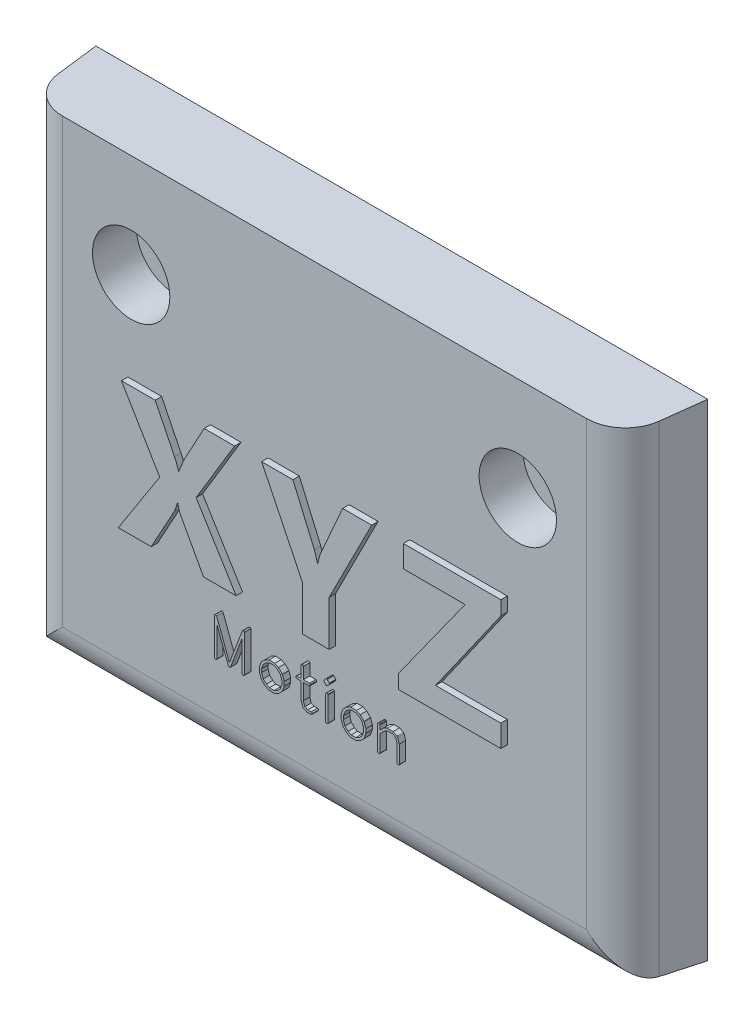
from build123d import *

# Parameters (mm, degrees)
SKETCH_1_W          = 46
SKETCH_1_H          = 37
EXTRUDE_1_DEPTH     = 6
SKETCH_2_R          = 3
CUT_EXTRUDE_1_DEPTH = 3.4
SKETCH_3_R          = 1.7
CUT_EXTRUDE_2_DEPTH = 6
DRAFT_1_ANGLE       = 7
DRAFT_2_ANGLE       = 7
DRAFT_4_ANGLE       = 7
SHELL_1_T           = -1.5
FILLET_1_R          = 1.5
FILLET_2_R          = 3
CUT_EXTRUDE_3_DEPTH = 0.2
EXTRUDE_2_DEPTH     = 0.5


with BuildPart() as part:
    # Sketch 1 → Extrude 1 (new body)
    with BuildSketch(Plane.XY):
        Rectangle(SKETCH_1_W, SKETCH_1_H)
    extrude(amount=EXTRUDE_1_DEPTH)

    # Sketch 2 → Cut-Extrude 1 (cut)
    with BuildSketch(Plane.XY.offset(6)):
        with Locations((-15, 10.5)):
            Circle(SKETCH_2_R)
        with Locations((15, 10.5)):
            Circle(SKETCH_2_R)
    extrude(amount=-CUT_EXTRUDE_1_DEPTH, mode=Mode.SUBTRACT)

    # Sketch 3 → Cut-Extrude 2 (cut)
    with BuildSketch(Plane.XY.offset(6)):
        with Locations((-15, 10.5)):
            Circle(SKETCH_3_R)
        with Locations((15, 10.5)):
            Circle(SKETCH_3_R)
    extrude(amount=-CUT_EXTRUDE_2_DEPTH, mode=Mode.SUBTRACT)

    # Draft 1
    draft_1_faces = [part.faces().sort_by_distance(p)[0] for p in [
        (0, -18.5, 3),
    ]]
    draft(draft_1_faces, Plane(origin=(23, 18.5, 6), x_dir=(1, 0, 0), z_dir=(0, 0, 1)), DRAFT_1_ANGLE)

    # Draft 2
    draft_2_faces = [part.faces().sort_by_distance(p)[0] for p in [
        (-23, -0.184782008, 2.99014263),
    ]]
    draft(draft_2_faces, Plane(origin=(23, 18.5, 6), x_dir=(1, 0, 0), z_dir=(0, 0, 1)), DRAFT_2_ANGLE)

    # Draft 4
    draft_4_faces = [part.faces().sort_by_distance(p)[0] for p in [
        (23, -0.184782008, 2.99014263),
    ]]
    draft(draft_4_faces, Plane(origin=(23, 18.5, 6), x_dir=(1, 0, 0), z_dir=(0, 0, 1)), DRAFT_4_ANGLE)

    # Shell 1
    shell_1_openings = [part.faces().sort_by_distance(p)[0] for p in [
        (0, -0.479642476, 0),
    ]]
    offset(amount=SHELL_1_T, openings=shell_1_openings, kind=Kind.INTERSECTION)

    # Fillet 1
    fillet_1_edges = [part.edges().sort_by_distance(p)[0] for p in [
        (21.949177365, -17.449177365, 2.25),
        (-21.949177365, -17.449177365, 2.25),
        (21.672912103, -0.086456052, 4.5),
        (-21.672912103, -0.086456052, 4.5),
        (0, -17.172912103, 4.5),
    ]]
    fillet(fillet_1_edges, radius=FILLET_1_R)

    # Fillet 2
    fillet_2_edges = [part.edges().sort_by_distance(p)[0] for p in [
        (-23, 0, 6),
        (0, -18.5, 6),
        (23, 0, 6),
    ]]
    fillet(fillet_2_edges, radius=FILLET_2_R)

    # Sketch 5 → Cut-Extrude 3 (cut)
    with BuildSketch(Plane(origin=(0, 0, 0), x_dir=(-1, 0, 0), z_dir=(0, 0, -1))):
        with BuildLine():
            Line((-20.7366234, -18.325442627), (20.7366234, -18.325442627))
            add(Edge.make_bspline(
                [(20.7366234, -18.325442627), (20.874594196, -18.325442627), (21.010292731, -18.31204549), (21.27730354, -18.259390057), (21.409995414, -18.219497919), (21.66314545, -18.115126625), (21.783209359, -18.051193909), (22.01040081, -17.899989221), (22.11801308, -17.811860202), (22.407194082, -17.522902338), (22.562645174, -17.289784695), (22.770526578, -16.786875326), (22.825442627, -16.512575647), (22.825442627, -16.2366234)],
                knots=[0, 0, 0, 0, 0.125, 0.125, 0.25, 0.25, 0.375, 0.375, 0.5, 0.5, 0.75, 0.75, 1, 1, 1, 1], degree=3))
            Line((22.825442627, -16.2366234), (22.825442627, 17.6))
            Line((22.825442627, 17.6), (-22.825442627, 17.6))
            Line((-22.825442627, 17.6), (-22.825442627, -16.2366234))
            add(Edge.make_bspline(
                [(-22.825442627, -16.2366234), (-22.825442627, -16.374594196), (-22.81204549, -16.510292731), (-22.759390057, -16.77730354), (-22.719497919, -16.909995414), (-22.615126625, -17.16314545), (-22.551193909, -17.283209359), (-22.399989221, -17.51040081), (-22.311860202, -17.61801308), (-22.022902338, -17.907194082), (-21.789784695, -18.062645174), (-21.286875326, -18.270526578), (-21.012575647, -18.325442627), (-20.7366234, -18.325442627)],
                knots=[0, 0, 0, 0, 0.125, 0.125, 0.25, 0.25, 0.375, 0.375, 0.5, 0.5, 0.75, 0.75, 1, 1, 1, 1], degree=3))
        make_face()
    extrude(amount=-CUT_EXTRUDE_3_DEPTH, mode=Mode.SUBTRACT)

    # Sketch 6 → Extrude 2 (add)
    # profile 1 of 10: a face of its own
    with BuildSketch(Plane.XY.offset(6)):
        with BuildLine():
            Line((-6.353658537, -6.5), (-8.887957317, -6.5))
            Line((-8.887957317, -6.5), (-10.686737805, -3.193978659))
            add(Edge.make_bspline(
                [(-10.686737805, -3.193978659), (-10.703182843, -3.158005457), (-10.740600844, -3.076154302), (-10.789138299, -2.931292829), (-10.83747696, -2.750216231), (-10.868211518, -2.616727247), (-10.884908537, -2.544207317)],
                knots=[0, 0, 0, 0, 0.69686081, 1.585593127, 2.688336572, 4, 4, 4, 4], degree=3))
            Line((-10.884908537, -2.544207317), (-10.911585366, -2.544207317))
            add(Edge.make_bspline(
                [(-10.911585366, -2.544207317), (-10.922581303, -2.58752126), (-10.946875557, -2.683218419), (-10.997379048, -2.837718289), (-11.065110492, -3.016945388), (-11.116479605, -3.144539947), (-11.144054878, -3.213033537)],
                knots=[0, 0, 0, 0, 0.756441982, 1.671271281, 2.749923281, 4, 4, 4, 4], degree=3))
            Line((-11.144054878, -3.213033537), (-12.946646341, -6.5))
            Line((-12.946646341, -6.5), (-15.5, -6.5))
            Line((-15.5, -6.5), (-12.281631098, -1.496189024))
            Line((-12.281631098, -1.496189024), (-15.256097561, 3.5))
            Line((-15.256097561, 3.5), (-12.637957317, 3.5))
            Line((-12.637957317, 3.5), (-11.132621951, 0.451219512))
            add(Edge.make_bspline(
                [(-11.132621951, 0.451219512), (-11.073269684, 0.321451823), (-10.950937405, 0.053984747), (-10.864580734, -0.227193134), (-10.820121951, -0.37195122)],
                knots=[0, 0, 0, 0, 0.970345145, 2, 2, 2, 2], degree=3))
            Line((-10.820121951, -0.37195122), (-10.79535061, -0.37195122))
            add(Edge.make_bspline(
                [(-10.79535061, -0.37195122), (-10.746444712, -0.232364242), (-10.645423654, 0.055969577), (-10.528121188, 0.338077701), (-10.467606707, 0.483612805)],
                knots=[0, 0, 0, 0, 0.968231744, 2, 2, 2, 2], degree=3))
            Line((-10.467606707, 0.483612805), (-8.836509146, 3.5))
            Line((-8.836509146, 3.5), (-6.475609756, 3.5))
            Line((-6.475609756, 3.5), (-9.463414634, -1.458079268))
            Line((-9.463414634, -1.458079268), (-6.353658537, -6.5))
        make_face()
    # profile 2 of 10: a face of its own
    with BuildSketch(Plane.XY.offset(6)):
        with BuildLine():
            Line((4.158536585, 3.5), (0.865853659, -2.993902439))
            Line((0.865853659, -2.993902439), (0.865853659, -6.5))
            Line((0.865853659, -6.5), (-1.207317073, -6.5))
            Line((-1.207317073, -6.5), (-1.207317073, -3.032012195))
            Line((-1.207317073, -3.032012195), (-4.37804878, 3.5))
            Line((-4.37804878, 3.5), (-1.954268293, 3.5))
            Line((-1.954268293, 3.5), (-0.283155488, -0.379573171))
            add(Edge.make_bspline(
                [(-0.283155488, -0.379573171), (-0.277960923, -0.392233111), (-0.265368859, -0.422921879), (-0.246493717, -0.478952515), (-0.224631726, -0.553137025), (-0.194821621, -0.643857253), (-0.165799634, -0.753276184), (-0.128889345, -0.879466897), (-0.086580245, -1.023186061), (-0.059325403, -1.125818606), (-0.044969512, -1.179878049)],
                knots=[0, 0, 0, 0, 0.393104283, 0.95291808, 1.697574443, 2.615321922, 3.695742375, 4.949119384, 6.393015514, 8, 8, 8, 8], degree=3))
            Line((-0.044969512, -1.179878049), (-0.020198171, -1.179878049))
            add(Edge.make_bspline(
                [(-0.020198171, -1.179878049), (-0.006995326, -1.106043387), (0.018520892, -0.963348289), (0.067870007, -0.759681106), (0.125051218, -0.573379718), (0.169725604, -0.456841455), (0.191310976, -0.400533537)],
                knots=[0, 0, 0, 0, 1.11217968, 2.149432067, 3.105859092, 4, 4, 4, 4], degree=3))
            Line((0.191310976, -0.400533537), (1.908155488, 3.5))
            Line((1.908155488, 3.5), (4.158536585, 3.5))
        make_face()
    # profile 3 of 10: a face of its own
    with BuildSketch(Plane.XY.offset(6)):
        Polygon((14.182926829, 2.402439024), (9.116234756, -4.792682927), (14.182926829, -4.792682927), (14.182926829, -6.5), (6.256097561, -6.5), (6.256097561, -5.402439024), (11.412347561, 1.792682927), (6.62195122, 1.792682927), (6.62195122, 3.5), (14.182926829, 3.5), align=None)
    # profile 4 of 10: a face of its own
    with BuildSketch(Plane.XY.offset(6)):
        with BuildLine():
            Line((-7.868861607, -8.620535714), (-6.877232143, -11.260044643))
            Line((-6.877232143, -11.260044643), (-5.872767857, -8.616629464))
            add(Edge.make_bspline(
                [(-5.872767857, -8.616629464), (-5.86841775, -8.609883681), (-5.86005258, -8.596911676), (-5.842972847, -8.581780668), (-5.822209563, -8.57280832), (-5.807380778, -8.571900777), (-5.799665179, -8.571428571)],
                knots=[0, 0, 0, 0, 1.061405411, 2.041061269, 2.980740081, 4, 4, 4, 4], degree=3))
            add(Edge.make_bspline(
                [(-5.799665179, -8.571428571), (-5.790807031, -8.571781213), (-5.773975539, -8.572451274), (-5.751394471, -8.582487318), (-5.733095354, -8.598470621), (-5.726254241, -8.612930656), (-5.72265625, -8.620535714)],
                knots=[0, 0, 0, 0, 1.080672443, 2.053401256, 2.976212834, 4, 4, 4, 4], degree=3))
            Line((-5.72265625, -8.620535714), (-5.714285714, -8.640625))
            Line((-5.714285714, -8.640625), (-5.714285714, -11.510602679))
            add(Edge.make_bspline(
                [(-5.714285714, -11.510602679), (-5.717335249, -11.518693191), (-5.723197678, -11.534246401), (-5.739957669, -11.552848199), (-5.761279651, -11.566538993), (-5.77806937, -11.569752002), (-5.786830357, -11.571428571)],
                knots=[0, 0, 0, 0, 1.025968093, 1.972322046, 2.941944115, 4, 4, 4, 4], degree=3))
            add(Edge.make_bspline(
                [(-5.786830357, -11.571428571), (-5.79729353, -11.570861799), (-5.81701142, -11.569793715), (-5.84460501, -11.562704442), (-5.867958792, -11.549880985), (-5.879042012, -11.537013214), (-5.884486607, -11.530691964)],
                knots=[0, 0, 0, 0, 1.143631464, 2.15517809, 3.093737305, 4, 4, 4, 4], degree=3))
            Line((-5.884486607, -11.530691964), (-5.892857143, -11.502790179))
            Line((-5.892857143, -11.502790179), (-5.892857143, -9.143973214))
            Line((-5.892857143, -9.143973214), (-5.896763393, -9.143973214))
            Line((-5.896763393, -9.143973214), (-6.800223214, -11.530691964))
            add(Edge.make_bspline(
                [(-6.800223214, -11.530691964), (-6.804749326, -11.536924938), (-6.813601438, -11.549115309), (-6.832486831, -11.562764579), (-6.855748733, -11.569753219), (-6.872352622, -11.570848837), (-6.881138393, -11.571428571)],
                knots=[0, 0, 0, 0, 0.970348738, 1.897795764, 2.88764101, 4, 4, 4, 4], degree=3))
            add(Edge.make_bspline(
                [(-6.881138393, -11.571428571), (-6.88927363, -11.570874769), (-6.904950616, -11.569807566), (-6.926042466, -11.55888271), (-6.94323677, -11.541827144), (-6.950057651, -11.526904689), (-6.953683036, -11.518973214)],
                knots=[0, 0, 0, 0, 1.014361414, 1.954722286, 2.912908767, 4, 4, 4, 4], degree=3))
            Line((-6.953683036, -11.518973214), (-7.857142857, -9.1484375))
            Line((-7.857142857, -9.1484375), (-7.857142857, -11.506696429))
            add(Edge.make_bspline(
                [(-7.857142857, -11.506696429), (-7.859599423, -11.513739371), (-7.864480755, -11.527734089), (-7.877818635, -11.54599534), (-7.895645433, -11.560768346), (-7.909619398, -11.567792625), (-7.916852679, -11.571428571)],
                knots=[0, 0, 0, 0, 0.978495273, 1.944324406, 2.935929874, 4, 4, 4, 4], degree=3))
            Line((-7.916852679, -11.571428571), (-7.946428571, -11.571428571))
            add(Edge.make_bspline(
                [(-7.946428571, -11.571428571), (-7.959084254, -11.570670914), (-7.982543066, -11.569266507), (-8.012958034, -11.553895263), (-8.032269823, -11.528433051), (-8.034552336, -11.508482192), (-8.035714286, -11.498325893)],
                knots=[0, 0, 0, 0, 1.167364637, 2.163849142, 3.065278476, 4, 4, 4, 4], degree=3))
            Line((-8.035714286, -11.498325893), (-8.035714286, -8.632254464))
            add(Edge.make_bspline(
                [(-8.035714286, -8.632254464), (-8.031900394, -8.624126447), (-8.024482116, -8.608316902), (-8.005388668, -8.589916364), (-7.98189383, -8.576314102), (-7.963729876, -8.573104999), (-7.954241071, -8.571428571)],
                knots=[0, 0, 0, 0, 0.999846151, 1.944768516, 2.926352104, 4, 4, 4, 4], degree=3))
            add(Edge.make_bspline(
                [(-7.954241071, -8.571428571), (-7.944836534, -8.571805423), (-7.926778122, -8.572529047), (-7.902261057, -8.582450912), (-7.88164044, -8.598169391), (-7.873228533, -8.612892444), (-7.868861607, -8.620535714)],
                knots=[0, 0, 0, 0, 1.076138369, 2.066380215, 2.996187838, 4, 4, 4, 4], degree=3))
        make_face()
    # profile 5 of 10: a face of its own
    with BuildSketch(Plane.XY.offset(6)):
        with BuildLine():
            Line((-3.066964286, -9.680803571), (-2.780691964, -9.963169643))
            Line((-2.780691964, -9.963169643), (-2.760044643, -9.991071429))
            add(Edge.make_bspline(
                [(-2.760044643, -9.991071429), (-2.738438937, -10.061373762), (-2.696403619, -10.198151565), (-2.648353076, -10.33293252), (-2.625, -10.3984375)],
                knots=[0, 0, 0, 0, 1.0279787, 2, 2, 2, 2], degree=3))
            Line((-2.625, -10.3984375), (-2.625, -10.704799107))
            add(Edge.make_bspline(
                [(-2.625, -10.704799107), (-2.629696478, -10.718362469), (-2.640032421, -10.748212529), (-2.655888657, -10.797554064), (-2.675750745, -10.855044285), (-2.697053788, -10.918256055), (-2.71749377, -10.981571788), (-2.737482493, -11.038209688), (-2.753119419, -11.086333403), (-2.763689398, -11.114981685), (-2.768415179, -11.127790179)],
                knots=[0, 0, 0, 0, 0.771228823, 1.69730985, 2.784597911, 4.039386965, 5.281533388, 6.359362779, 7.266479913, 8, 8, 8, 8], degree=3))
            Line((-2.768415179, -11.127790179), (-2.780691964, -11.1484375))
            Line((-2.780691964, -11.1484375), (-3.071428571, -11.430245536))
            add(Edge.make_bspline(
                [(-3.071428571, -11.430245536), (-3.080547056, -11.434701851), (-3.101026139, -11.444710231), (-3.134564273, -11.461346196), (-3.17458317, -11.480456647), (-3.218645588, -11.500943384), (-3.262586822, -11.522079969), (-3.302563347, -11.540696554), (-3.336276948, -11.557173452), (-3.356765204, -11.566976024), (-3.366071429, -11.571428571)],
                knots=[0, 0, 0, 0, 0.745514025, 1.674340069, 2.749955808, 4.00299426, 5.243679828, 6.331635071, 7.242191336, 8, 8, 8, 8], degree=3))
            Line((-3.366071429, -11.571428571), (-3.81640625, -11.571428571))
            Line((-3.81640625, -11.571428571), (-4.111607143, -11.430245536))
            Line((-4.111607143, -11.430245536), (-4.40625, -11.136160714))
            add(Edge.make_bspline(
                [(-4.40625, -11.136160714), (-4.410516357, -11.12332189), (-4.419549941, -11.096136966), (-4.434105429, -11.053183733), (-4.450120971, -11.005878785), (-4.468388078, -10.954371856), (-4.486907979, -10.898163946), (-4.507900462, -10.837641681), (-4.529940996, -10.772627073), (-4.54553968, -10.727853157), (-4.553571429, -10.704799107)],
                knots=[0, 0, 0, 0, 0.712325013, 1.508276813, 2.387865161, 3.341841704, 4.385557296, 5.503636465, 6.71462463, 8, 8, 8, 8], degree=3))
            Line((-4.553571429, -10.704799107), (-4.553571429, -10.39453125))
            add(Edge.make_bspline(
                [(-4.553571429, -10.39453125), (-4.545482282, -10.372427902), (-4.529811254, -10.329607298), (-4.508563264, -10.266979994), (-4.487350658, -10.20908586), (-4.469422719, -10.154843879), (-4.451855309, -10.105150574), (-4.436167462, -10.059657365), (-4.422923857, -10.018004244), (-4.414270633, -9.991808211), (-4.41015625, -9.979352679)],
                knots=[0, 0, 0, 0, 1.285914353, 2.491189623, 3.613025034, 4.654310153, 5.612103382, 6.492703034, 7.283319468, 8, 8, 8, 8], degree=3))
            add(Edge.make_bspline(
                [(-4.41015625, -9.979352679), (-4.408667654, -9.97786509), (-4.402527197, -9.971728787), (-4.38872176, -9.957816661), (-4.365043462, -9.934995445), (-4.332395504, -9.902723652), (-4.290311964, -9.86128843), (-4.239180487, -9.810482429), (-4.178158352, -9.750974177), (-4.134815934, -9.707818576), (-4.111607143, -9.684709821)],
                knots=[0, 0, 0, 0, 0.120410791, 0.496694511, 1.121370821, 2.001906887, 3.123257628, 4.500476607, 6.12609196, 8, 8, 8, 8], degree=3))
            Line((-4.111607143, -9.684709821), (-3.81640625, -9.539620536))
            Line((-3.81640625, -9.539620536), (-3.796316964, -9.535714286))
            Line((-3.796316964, -9.535714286), (-3.357700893, -9.539620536))
            Line((-3.357700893, -9.539620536), (-3.066964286, -9.680803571))
        make_face()
        Polygon((-3.169084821, -9.830357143), (-3.400669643, -9.714285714), (-3.773995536, -9.714285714), (-4.009486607, -9.830357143), (-4.248883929, -10.065848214), (-4.375, -10.421875), (-4.375, -10.673549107), (-4.253348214, -11.037388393), (-4.013392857, -11.272879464), (-3.773995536, -11.392857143), (-3.404575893, -11.392857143), (-3.169084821, -11.280691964), (-2.925223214, -11.037388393), (-2.803571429, -10.677455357), (-2.803571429, -10.43359375), (-2.925223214, -10.069754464), align=None, mode=Mode.SUBTRACT)
    # profile 6 of 10: a face of its own
    with BuildSketch(Plane.XY.offset(6)):
        with BuildLine():
            Line((-1.142857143, -8.642299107), (-1.142857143, -9.535714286))
            Line((-1.142857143, -9.535714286), (-0.665178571, -9.535714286))
            add(Edge.make_bspline(
                [(-0.665178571, -9.535714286), (-0.656867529, -9.538090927), (-0.6409721, -9.542636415), (-0.622437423, -9.559177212), (-0.608560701, -9.580012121), (-0.605438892, -9.59668643), (-0.603794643, -9.60546875)],
                knots=[0, 0, 0, 0, 1.030967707, 1.971795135, 2.931749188, 4, 4, 4, 4], degree=3))
            add(Edge.make_bspline(
                [(-0.603794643, -9.60546875), (-0.604119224, -9.616312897), (-0.604714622, -9.636204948), (-0.611550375, -9.663566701), (-0.62273445, -9.686290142), (-0.63485164, -9.696558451), (-0.640625, -9.701450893)],
                knots=[0, 0, 0, 0, 1.215945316, 2.230479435, 3.156893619, 4, 4, 4, 4], degree=3))
            Line((-0.640625, -9.701450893), (-0.672991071, -9.714285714))
            Line((-0.672991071, -9.714285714), (-1.142857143, -9.714285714))
            Line((-1.142857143, -9.714285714), (-1.142857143, -10.946428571))
            Line((-1.142857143, -10.946428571), (-1.024553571, -11.2890625))
            Line((-1.024553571, -11.2890625), (-0.804129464, -11.392857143))
            Line((-0.804129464, -11.392857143), (-0.534598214, -11.392857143))
            add(Edge.make_bspline(
                [(-0.534598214, -11.392857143), (-0.524251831, -11.395672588), (-0.50478756, -11.400969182), (-0.480490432, -11.420287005), (-0.467600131, -11.44929357), (-0.466169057, -11.470677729), (-0.465401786, -11.482142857)],
                knots=[0, 0, 0, 0, 1.029396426, 1.936565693, 2.893688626, 4, 4, 4, 4], degree=3))
            add(Edge.make_bspline(
                [(-0.465401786, -11.482142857), (-0.465458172, -11.492231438), (-0.465558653, -11.510209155), (-0.473982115, -11.52599627), (-0.477678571, -11.532924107)],
                knots=[0, 0, 0, 0, 1.122342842, 2, 2, 2, 2], degree=3))
            add(Edge.make_bspline(
                [(-0.477678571, -11.532924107), (-0.485253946, -11.542012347), (-0.500630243, -11.560459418), (-0.523535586, -11.567736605), (-0.53515625, -11.571428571)],
                knots=[0, 0, 0, 0, 0.985331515, 2, 2, 2, 2], degree=3))
            Line((-0.53515625, -11.571428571), (-0.852120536, -11.571428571))
            Line((-0.852120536, -11.571428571), (-1.1484375, -11.426897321))
            add(Edge.make_bspline(
                [(-1.1484375, -11.426897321), (-1.153743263, -11.423679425), (-1.164673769, -11.417050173), (-1.176334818, -11.400077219), (-1.185447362, -11.379097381), (-1.188232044, -11.363015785), (-1.189732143, -11.354352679)],
                knots=[0, 0, 0, 0, 0.849806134, 1.750702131, 2.788310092, 4, 4, 4, 4], degree=3))
            add(Edge.make_bspline(
                [(-1.189732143, -11.354352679), (-1.193626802, -11.343373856), (-1.2019474, -11.319918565), (-1.215457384, -11.282637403), (-1.229831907, -11.240921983), (-1.245339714, -11.195058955), (-1.2627824, -11.145507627), (-1.281269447, -11.091773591), (-1.300668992, -11.033630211), (-1.314338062, -10.993482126), (-1.321428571, -10.97265625)],
                knots=[0, 0, 0, 0, 0.69239786, 1.479247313, 2.356867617, 3.314864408, 4.356839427, 5.479183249, 6.692385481, 8, 8, 8, 8], degree=3))
            Line((-1.321428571, -10.97265625), (-1.321428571, -9.714285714))
            Line((-1.321428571, -9.714285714), (-1.646763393, -9.714285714))
            add(Edge.make_bspline(
                [(-1.646763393, -9.714285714), (-1.654766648, -9.711502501), (-1.669874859, -9.706248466), (-1.688463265, -9.693012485), (-1.703032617, -9.677687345), (-1.707948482, -9.665210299), (-1.710379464, -9.659040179)],
                knots=[0, 0, 0, 0, 1.154393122, 2.179215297, 3.099589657, 4, 4, 4, 4], degree=3))
            add(Edge.make_bspline(
                [(-1.710379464, -9.659040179), (-1.7114486, -9.653661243), (-1.713972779, -9.640961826), (-1.714171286, -9.628004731), (-1.714285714, -9.620535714)],
                knots=[0, 0, 0, 0, 0.847115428, 2, 2, 2, 2], degree=3))
            add(Edge.make_bspline(
                [(-1.714285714, -9.620535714), (-1.713557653, -9.609008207), (-1.712218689, -9.587808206), (-1.693475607, -9.562265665), (-1.669676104, -9.545883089), (-1.65176566, -9.539092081), (-1.642857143, -9.535714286)],
                knots=[0, 0, 0, 0, 1.134001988, 2.085519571, 3.047752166, 4, 4, 4, 4], degree=3))
            Line((-1.642857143, -9.535714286), (-1.321428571, -9.535714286))
            Line((-1.321428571, -9.535714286), (-1.321428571, -8.630022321))
            add(Edge.make_bspline(
                [(-1.321428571, -8.630022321), (-1.318980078, -8.622297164), (-1.314195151, -8.607200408), (-1.297936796, -8.589434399), (-1.276959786, -8.576300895), (-1.26043113, -8.573115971), (-1.251674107, -8.571428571)],
                knots=[0, 0, 0, 0, 0.990828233, 1.936309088, 2.90663893, 4, 4, 4, 4], degree=3))
            add(Edge.make_bspline(
                [(-1.251674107, -8.571428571), (-1.237208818, -8.572055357), (-1.211014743, -8.573190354), (-1.176466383, -8.586578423), (-1.151520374, -8.610384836), (-1.14582178, -8.631377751), (-1.142857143, -8.642299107)],
                knots=[0, 0, 0, 0, 1.213648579, 2.197702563, 3.062372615, 4, 4, 4, 4], degree=3))
        make_face()
    # profile 7 of 10: a face of its own
    with BuildSketch(Plane.XY.offset(6)):
        with BuildLine():
            Line((0.71484375, -8.588169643), (0.873325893, -8.756696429))
            add(Edge.make_bspline(
                [(0.873325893, -8.756696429), (0.877040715, -8.764170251), (0.883631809, -8.777430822), (0.88500391, -8.792133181), (0.885602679, -8.798549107)],
                knots=[0, 0, 0, 0, 1.12722483, 2, 2, 2, 2], degree=3))
            add(Edge.make_bspline(
                [(0.885602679, -8.798549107), (0.8847961, -8.807233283), (0.88307422, -8.825772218), (0.869257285, -8.853082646), (0.848218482, -8.881052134), (0.830090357, -8.898508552), (0.8203125, -8.907924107)],
                knots=[0, 0, 0, 0, 0.794128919, 1.69530249, 2.756903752, 4, 4, 4, 4], degree=3))
            add(Edge.make_bspline(
                [(0.8203125, -8.907924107), (0.807041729, -8.920509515), (0.783557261, -8.942781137), (0.75379063, -8.972526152), (0.732369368, -8.992833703), (0.722414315, -9.004598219), (0.71875, -9.008928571)],
                knots=[0, 0, 0, 0, 1.531439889, 2.710095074, 3.525204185, 4, 4, 4, 4], degree=3))
            add(Edge.make_bspline(
                [(0.71875, -9.008928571), (0.709562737, -9.014962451), (0.692168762, -9.026386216), (0.67155582, -9.028932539), (0.661830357, -9.030133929)],
                knots=[0, 0, 0, 0, 1.056373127, 2, 2, 2, 2], degree=3))
            add(Edge.make_bspline(
                [(0.661830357, -9.030133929), (0.655763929, -9.029814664), (0.644386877, -9.029215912), (0.634213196, -9.024135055), (0.629464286, -9.021763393)],
                knots=[0, 0, 0, 0, 1.066432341, 2, 2, 2, 2], degree=3))
            Line((0.629464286, -9.021763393), (0.604910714, -9.005022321))
            Line((0.604910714, -9.005022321), (0.454799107, -8.844866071))
            add(Edge.make_bspline(
                [(0.454799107, -8.844866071), (0.453333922, -8.841939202), (0.449744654, -8.834769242), (0.448555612, -8.820095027), (0.446521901, -8.800852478), (0.446461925, -8.786103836), (0.446428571, -8.777901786)],
                knots=[0, 0, 0, 0, 0.572965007, 1.403594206, 2.556080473, 4, 4, 4, 4], degree=3))
            Line((0.446428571, -8.777901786), (0.458705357, -8.752232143))
            Line((0.458705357, -8.752232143), (0.61328125, -8.592633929))
            add(Edge.make_bspline(
                [(0.61328125, -8.592633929), (0.618991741, -8.586337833), (0.631818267, -8.572195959), (0.651121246, -8.571702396), (0.661830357, -8.571428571)],
                knots=[0, 0, 0, 0, 0.890418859, 2, 2, 2, 2], degree=3))
            add(Edge.make_bspline(
                [(0.661830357, -8.571428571), (0.669758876, -8.572337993), (0.688445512, -8.574481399), (0.705198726, -8.583168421), (0.71484375, -8.588169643)],
                knots=[0, 0, 0, 0, 0.848576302, 2, 2, 2, 2], degree=3))
        make_face()
    # profile 8 of 10: a face of its own
    with BuildSketch(Plane.XY.offset(6)):
        with BuildLine():
            Line((0.758928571, -9.575892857), (0.767857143, -9.604352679))
            Line((0.767857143, -9.604352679), (0.767857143, -11.511160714))
            add(Edge.make_bspline(
                [(0.767857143, -11.511160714), (0.765809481, -11.519214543), (0.761883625, -11.534655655), (0.746717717, -11.553916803), (0.724607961, -11.566663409), (0.707392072, -11.569758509), (0.698102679, -11.571428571)],
                knots=[0, 0, 0, 0, 0.992786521, 1.903408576, 2.868715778, 4, 4, 4, 4], degree=3))
            add(Edge.make_bspline(
                [(0.698102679, -11.571428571), (0.686117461, -11.571027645), (0.664207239, -11.570294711), (0.635021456, -11.561944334), (0.611430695, -11.548485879), (0.602574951, -11.534319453), (0.598214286, -11.52734375)],
                knots=[0, 0, 0, 0, 1.247110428, 2.279847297, 3.152978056, 4, 4, 4, 4], degree=3))
            Line((0.598214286, -11.52734375), (0.589285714, -11.511160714))
            Line((0.589285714, -11.511160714), (0.589285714, -9.600446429))
            add(Edge.make_bspline(
                [(0.589285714, -9.600446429), (0.591789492, -9.592760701), (0.596771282, -9.577468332), (0.61277994, -9.558758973), (0.633759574, -9.544170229), (0.650284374, -9.538642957), (0.659040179, -9.535714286)],
                knots=[0, 0, 0, 0, 0.963007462, 1.916105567, 2.895830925, 4, 4, 4, 4], degree=3))
            add(Edge.make_bspline(
                [(0.659040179, -9.535714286), (0.670473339, -9.535919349), (0.691617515, -9.536298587), (0.72005467, -9.544594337), (0.744161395, -9.556159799), (0.754124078, -9.569472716), (0.758928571, -9.575892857)],
                knots=[0, 0, 0, 0, 1.215174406, 2.247310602, 3.154767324, 4, 4, 4, 4], degree=3))
        make_face()
    # profile 9 of 10: a face of its own
    with BuildSketch(Plane.XY.offset(6)):
        with BuildLine():
            Line((3.272321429, -9.680803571), (3.55859375, -9.963169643))
            Line((3.55859375, -9.963169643), (3.579241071, -9.991071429))
            add(Edge.make_bspline(
                [(3.579241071, -9.991071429), (3.600846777, -10.061373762), (3.642882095, -10.198151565), (3.690932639, -10.33293252), (3.714285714, -10.3984375)],
                knots=[0, 0, 0, 0, 1.0279787, 2, 2, 2, 2], degree=3))
            Line((3.714285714, -10.3984375), (3.714285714, -10.704799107))
            add(Edge.make_bspline(
                [(3.714285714, -10.704799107), (3.709589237, -10.718362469), (3.699253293, -10.748212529), (3.683397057, -10.797554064), (3.663534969, -10.855044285), (3.642231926, -10.918256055), (3.621791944, -10.981571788), (3.601803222, -11.038209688), (3.586166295, -11.086333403), (3.575596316, -11.114981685), (3.570870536, -11.127790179)],
                knots=[0, 0, 0, 0, 0.771228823, 1.69730985, 2.784597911, 4.039386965, 5.281533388, 6.359362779, 7.266479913, 8, 8, 8, 8], degree=3))
            Line((3.570870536, -11.127790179), (3.55859375, -11.1484375))
            Line((3.55859375, -11.1484375), (3.267857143, -11.430245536))
            add(Edge.make_bspline(
                [(3.267857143, -11.430245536), (3.258738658, -11.434701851), (3.238259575, -11.444710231), (3.204721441, -11.461346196), (3.164702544, -11.480456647), (3.120640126, -11.500943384), (3.076698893, -11.522079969), (3.036722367, -11.540696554), (3.003008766, -11.557173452), (2.98252051, -11.566976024), (2.973214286, -11.571428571)],
                knots=[0, 0, 0, 0, 0.745514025, 1.674340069, 2.749955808, 4.00299426, 5.243679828, 6.331635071, 7.242191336, 8, 8, 8, 8], degree=3))
            Line((2.973214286, -11.571428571), (2.522879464, -11.571428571))
            Line((2.522879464, -11.571428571), (2.227678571, -11.430245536))
            Line((2.227678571, -11.430245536), (1.933035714, -11.136160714))
            add(Edge.make_bspline(
                [(1.933035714, -11.136160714), (1.928769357, -11.12332189), (1.919735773, -11.096136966), (1.905180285, -11.053183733), (1.889164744, -11.005878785), (1.870897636, -10.954371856), (1.852377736, -10.898163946), (1.831385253, -10.837641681), (1.809344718, -10.772627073), (1.793746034, -10.727853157), (1.785714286, -10.704799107)],
                knots=[0, 0, 0, 0, 0.712325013, 1.508276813, 2.387865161, 3.341841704, 4.385557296, 5.503636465, 6.71462463, 8, 8, 8, 8], degree=3))
            Line((1.785714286, -10.704799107), (1.785714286, -10.39453125))
            add(Edge.make_bspline(
                [(1.785714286, -10.39453125), (1.793803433, -10.372427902), (1.80947446, -10.329607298), (1.83072245, -10.266979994), (1.851935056, -10.20908586), (1.869862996, -10.154843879), (1.887430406, -10.105150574), (1.903118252, -10.059657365), (1.916361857, -10.018004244), (1.925015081, -9.991808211), (1.929129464, -9.979352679)],
                knots=[0, 0, 0, 0, 1.285914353, 2.491189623, 3.613025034, 4.654310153, 5.612103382, 6.492703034, 7.283319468, 8, 8, 8, 8], degree=3))
            add(Edge.make_bspline(
                [(1.929129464, -9.979352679), (1.93061806, -9.97786509), (1.936758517, -9.971728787), (1.950563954, -9.957816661), (1.974242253, -9.934995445), (2.00689021, -9.902723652), (2.04897375, -9.86128843), (2.100105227, -9.810482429), (2.161127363, -9.750974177), (2.204469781, -9.707818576), (2.227678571, -9.684709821)],
                knots=[0, 0, 0, 0, 0.120410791, 0.496694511, 1.121370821, 2.001906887, 3.123257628, 4.500476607, 6.12609196, 8, 8, 8, 8], degree=3))
            Line((2.227678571, -9.684709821), (2.522879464, -9.539620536))
            Line((2.522879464, -9.539620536), (2.54296875, -9.535714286))
            Line((2.54296875, -9.535714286), (2.981584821, -9.539620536))
            Line((2.981584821, -9.539620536), (3.272321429, -9.680803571))
        make_face()
        Polygon((3.170200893, -9.830357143), (2.938616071, -9.714285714), (2.565290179, -9.714285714), (2.329799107, -9.830357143), (2.090401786, -10.065848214), (1.964285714, -10.421875), (1.964285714, -10.673549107), (2.0859375, -11.037388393), (2.325892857, -11.272879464), (2.565290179, -11.392857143), (2.934709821, -11.392857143), (3.170200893, -11.280691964), (3.4140625, -11.037388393), (3.535714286, -10.677455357), (3.535714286, -10.43359375), (3.4140625, -10.069754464), align=None, mode=Mode.SUBTRACT)
    # profile 10 of 10: a face of its own
    with BuildSketch(Plane.XY.offset(6)):
        with BuildLine():
            add(Edge.make_bspline(
                [(6.125, -9.684709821), (6.130439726, -9.687954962), (6.141704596, -9.694675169), (6.154760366, -9.711120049), (6.163498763, -9.732636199), (6.166763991, -9.748623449), (6.168526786, -9.757254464)],
                knots=[0, 0, 0, 0, 0.858385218, 1.777589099, 2.800189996, 4, 4, 4, 4], degree=3))
            add(Edge.make_bspline(
                [(6.168526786, -9.757254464), (6.172479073, -9.768585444), (6.180887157, -9.792690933), (6.193190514, -9.831134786), (6.208738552, -9.872876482), (6.224924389, -9.918821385), (6.241886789, -9.968855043), (6.261183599, -10.022685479), (6.281551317, -10.080449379), (6.296089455, -10.120178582), (6.303571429, -10.140625)],
                knots=[0, 0, 0, 0, 0.708551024, 1.507369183, 2.382844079, 3.338110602, 4.383572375, 5.502111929, 6.714475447, 8, 8, 8, 8], degree=3))
            Line((6.303571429, -10.140625), (6.303571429, -11.515066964))
            add(Edge.make_bspline(
                [(6.303571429, -11.515066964), (6.302349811, -11.521385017), (6.299899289, -11.534058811), (6.28744179, -11.550597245), (6.26888197, -11.563553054), (6.253720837, -11.56866744), (6.245535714, -11.571428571)],
                knots=[0, 0, 0, 0, 0.886944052, 1.779178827, 2.801033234, 4, 4, 4, 4], degree=3))
            add(Edge.make_bspline(
                [(6.245535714, -11.571428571), (6.236013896, -11.571391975), (6.21851573, -11.571324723), (6.194784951, -11.566526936), (6.175222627, -11.560470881), (6.157125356, -11.548022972), (6.142437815, -11.528819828), (6.139666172, -11.51136644), (6.138392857, -11.503348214)],
                knots=[0, 0, 0, 0, 1.205366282, 2.215091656, 3.066595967, 3.780579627, 4.980380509, 6, 6, 6, 6], degree=3))
            Line((6.138392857, -11.503348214), (6.133928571, -10.163504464))
            Line((6.133928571, -10.163504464), (6.010044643, -9.822544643))
            Line((6.010044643, -9.822544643), (5.791294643, -9.714285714))
            Line((5.791294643, -9.714285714), (5.415178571, -9.714285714))
            Line((5.415178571, -9.714285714), (5.171316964, -9.834821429))
            Line((5.171316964, -9.834821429), (4.803571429, -10.195870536))
            Line((4.803571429, -10.195870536), (4.803571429, -11.507254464))
            add(Edge.make_bspline(
                [(4.803571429, -11.507254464), (4.801149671, -11.514322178), (4.79638649, -11.52822315), (4.782690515, -11.546028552), (4.7650933, -11.560785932), (4.751103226, -11.567798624), (4.743861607, -11.571428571)],
                knots=[0, 0, 0, 0, 0.983361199, 1.934101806, 2.930638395, 4, 4, 4, 4], degree=3))
            Line((4.743861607, -11.571428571), (4.714285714, -11.571428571))
            add(Edge.make_bspline(
                [(4.714285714, -11.571428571), (4.701630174, -11.570670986), (4.678171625, -11.56926671), (4.647754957, -11.553894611), (4.628564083, -11.528587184), (4.626195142, -11.508844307), (4.625, -11.498883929)],
                knots=[0, 0, 0, 0, 1.17231804, 2.173030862, 3.078285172, 4, 4, 4, 4], degree=3))
            Line((4.625, -11.498883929), (4.625, -9.600446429))
            add(Edge.make_bspline(
                [(4.625, -9.600446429), (4.627119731, -9.59056898), (4.631149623, -9.571790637), (4.65138539, -9.549694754), (4.680305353, -9.537111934), (4.702236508, -9.536209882), (4.714285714, -9.535714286)],
                knots=[0, 0, 0, 0, 0.977162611, 1.857716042, 2.823006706, 4, 4, 4, 4], degree=3))
            add(Edge.make_bspline(
                [(4.714285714, -9.535714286), (4.725917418, -9.536026), (4.747208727, -9.536596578), (4.765635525, -9.547122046), (4.773995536, -9.551897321)],
                knots=[0, 0, 0, 0, 1.092624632, 2, 2, 2, 2], degree=3))
            add(Edge.make_bspline(
                [(4.773995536, -9.551897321), (4.782643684, -9.560383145), (4.797827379, -9.575281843), (4.801842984, -9.595995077), (4.803571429, -9.604910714)],
                knots=[0, 0, 0, 0, 1.139136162, 2, 2, 2, 2], degree=3))
            Line((4.803571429, -9.604910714), (4.803571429, -9.945870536))
            Line((4.803571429, -9.945870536), (5.073660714, -9.680245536))
            Line((5.073660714, -9.680245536), (5.368303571, -9.539620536))
            Line((5.368303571, -9.539620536), (5.388392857, -9.535714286))
            Line((5.388392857, -9.535714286), (5.826450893, -9.539620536))
            Line((5.826450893, -9.539620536), (6.125, -9.684709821))
        make_face()
    extrude(amount=EXTRUDE_2_DEPTH)


solid = part.part
